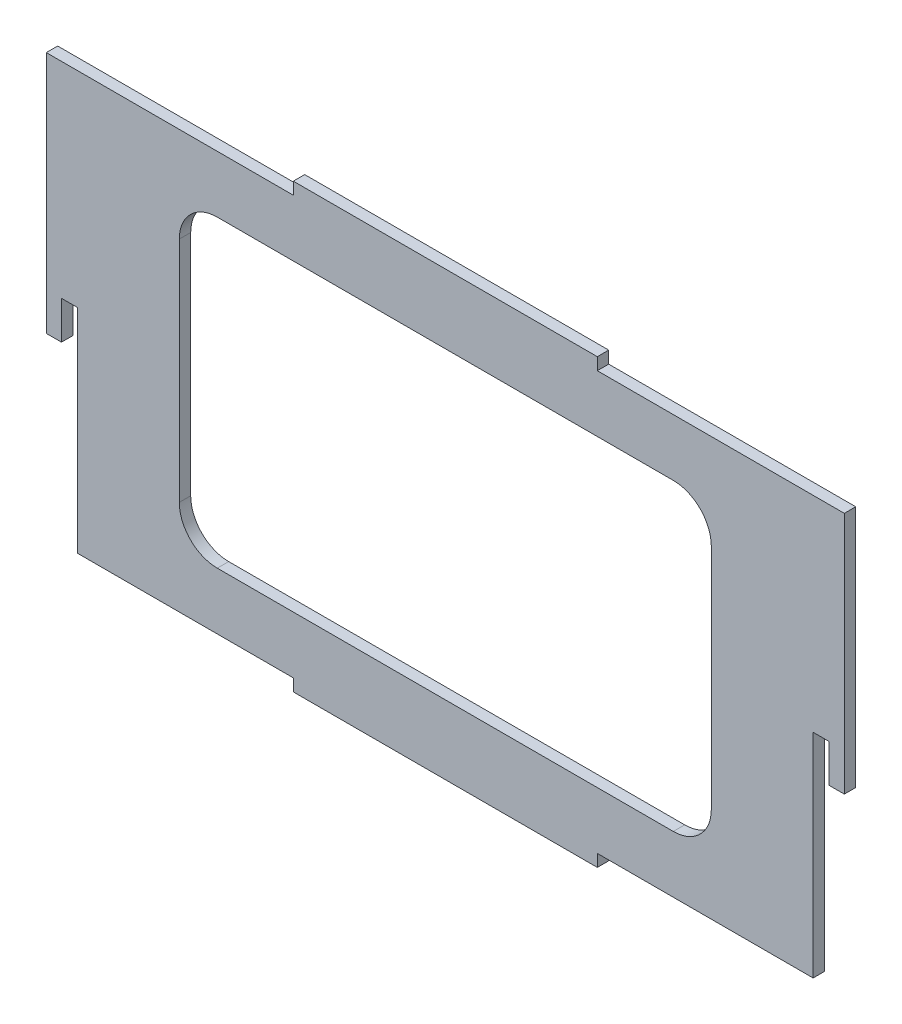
from build123d import *

# Parameters (mm, degrees)
BOSS_EXTRU_1_DEPTH      = 1.5
ESQUISSE2_W             = 2
ESQUISSE2_H             = 23
ENL_V_MAT_EXTRU_1_DEPTH = 10


with BuildPart() as part:
    # Esquisse1 → Boss.-Extru.1 (new body)
    with BuildSketch(Plane.XY):
        Polygon((-52.5, 27.5), (-52.5, -27.5), (-50.5, -27.5), (-50.5, 0.5), (-48.4, 0.5), (-48.4, -27.5), (-20, -27.5), (-20, -29.1), (20, -29.1), (20, -27.5), (48.4, -27.5), (48.4, 0.5), (50.5, 0.5), (50.5, -27.5), (52.5, -27.5), (52.5, 27.5), (20, 27.5), (20, 29.1), (-20, 29.1), (-20, 27.5), align=None)
        with BuildLine():
            Line((-30, 20), (30, 20))
            ThreePointArc((30, 20), (33.535533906, 18.535533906), (35, 15))
            Line((35, 15), (35, -15))
            ThreePointArc((35, -15), (33.535533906, -18.535533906), (30, -20))
            Line((30, -20), (-30, -20))
            ThreePointArc((-30, -20), (-33.535533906, -18.535533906), (-35, -15))
            Line((-35, -15), (-35, 15))
            ThreePointArc((-35, 15), (-33.535533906, 18.535533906), (-30, 20))
        make_face(mode=Mode.SUBTRACT)
    extrude(amount=BOSS_EXTRU_1_DEPTH)

    # Esquisse2 → Enl_v. mat.-Extru.1 (cut)
    with BuildSketch(Plane.XY):
        with Locations((-51.5, -16)):
            Rectangle(ESQUISSE2_W, ESQUISSE2_H)
        with Locations((51.5, -16)):
            Rectangle(ESQUISSE2_W, ESQUISSE2_H)
    extrude(amount=ENL_V_MAT_EXTRU_1_DEPTH, mode=Mode.SUBTRACT)


solid = part.part
